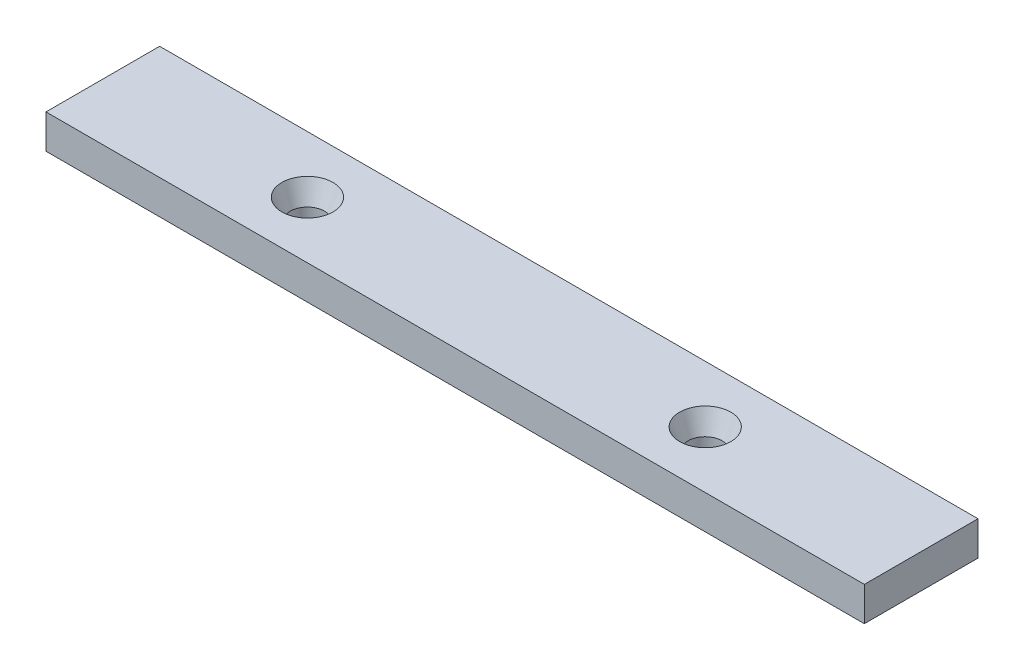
ISO-10303-21;
HEADER;
FILE_DESCRIPTION(('STEP AP214'),'2;1');
FILE_NAME('part.step','',(''),(''),'','','');
FILE_SCHEMA(('AUTOMOTIVE_DESIGN { 1 0 10303 214 1 1 1 1 }'));
ENDSEC;
DATA;
#1=APPLICATION_CONTEXT('core data for automotive mechanical design processes');
#2=APPLICATION_PROTOCOL_DEFINITION('international standard','automotive_design',2000,#1);
#3=PRODUCT_CONTEXT('',#1,'mechanical');
#4=PRODUCT('Part','Part','',(#3));
#5=PRODUCT_RELATED_PRODUCT_CATEGORY('part','',(#4));
#6=PRODUCT_DEFINITION_FORMATION('','',#4);
#7=PRODUCT_DEFINITION_CONTEXT('part definition',#1,'design');
#8=PRODUCT_DEFINITION('design','',#6,#7);
#9=PRODUCT_DEFINITION_SHAPE('','',#8);
#10=(LENGTH_UNIT() NAMED_UNIT(*) SI_UNIT(.MILLI.,.METRE.));
#11=(NAMED_UNIT(*) PLANE_ANGLE_UNIT() SI_UNIT($,.RADIAN.));
#12=(NAMED_UNIT(*) SI_UNIT($,.STERADIAN.) SOLID_ANGLE_UNIT());
#13=UNCERTAINTY_MEASURE_WITH_UNIT(LENGTH_MEASURE(1.E-05),#10,'distance_accuracy_value','');
#14=(GEOMETRIC_REPRESENTATION_CONTEXT(3) GLOBAL_UNCERTAINTY_ASSIGNED_CONTEXT((#13)) GLOBAL_UNIT_ASSIGNED_CONTEXT((#10,
#11,#12)) REPRESENTATION_CONTEXT('',''));
#15=CARTESIAN_POINT('',(0.,0.,0.));
#16=DIRECTION('',(0.,0.,1.));
#17=DIRECTION('',(1.,0.,0.));
#18=AXIS2_PLACEMENT_3D('',#15,#16,#17);
#19=CARTESIAN_POINT('',(72.0000000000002,6.,10.));
#20=DIRECTION('',(-1.,0.,0.));
#21=DIRECTION('',(0.,0.,1.));
#22=AXIS2_PLACEMENT_3D('',#19,#20,#21);
#23=PLANE('',#22);
#24=DIRECTION('',(0.,0.,-1.));
#25=VECTOR('',#24,1.);
#26=CARTESIAN_POINT('',(72.0000000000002,0.,10.));
#27=LINE('',#26,#25);
#28=CARTESIAN_POINT('',(72.0000000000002,0.,10.));
#29=VERTEX_POINT('',#28);
#30=CARTESIAN_POINT('',(72.0000000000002,0.,-10.0000000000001));
#31=VERTEX_POINT('',#30);
#32=EDGE_CURVE('E97',#29,#31,#27,.T.);
#33=ORIENTED_EDGE('',*,*,#32,.T.);
#34=DIRECTION('',(0.,-1.,0.));
#35=VECTOR('',#34,1.);
#36=CARTESIAN_POINT('',(72.0000000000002,6.,-10.0000000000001));
#37=LINE('',#36,#35);
#38=CARTESIAN_POINT('',(72.0000000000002,6.,-10.0000000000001));
#39=VERTEX_POINT('',#38);
#40=EDGE_CURVE('E11',#39,#31,#37,.T.);
#41=ORIENTED_EDGE('',*,*,#40,.F.);
#42=DIRECTION('',(0.,0.,-1.));
#43=VECTOR('',#42,1.);
#44=CARTESIAN_POINT('',(72.0000000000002,6.,10.));
#45=LINE('',#44,#43);
#46=CARTESIAN_POINT('',(72.0000000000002,6.,10.));
#47=VERTEX_POINT('',#46);
#48=EDGE_CURVE('E85',#47,#39,#45,.T.);
#49=ORIENTED_EDGE('',*,*,#48,.F.);
#50=DIRECTION('',(0.,-1.,0.));
#51=VECTOR('',#50,1.);
#52=CARTESIAN_POINT('',(72.0000000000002,6.,10.));
#53=LINE('',#52,#51);
#54=EDGE_CURVE('E93',#47,#29,#53,.T.);
#55=ORIENTED_EDGE('',*,*,#54,.T.);
#56=EDGE_LOOP('',(#33,#41,#49,#55));
#57=FACE_BOUND('',#56,.T.);
#58=ADVANCED_FACE('F34',(#57),#23,.F.);
#59=CARTESIAN_POINT('',(-72.0000000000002,6.,-10.0000000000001));
#60=DIRECTION('',(0.,0.,1.));
#61=DIRECTION('',(1.,0.,0.));
#62=AXIS2_PLACEMENT_3D('',#59,#60,#61);
#63=PLANE('',#62);
#64=DIRECTION('',(-1.,0.,0.));
#65=VECTOR('',#64,1.);
#66=CARTESIAN_POINT('',(-72.0000000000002,0.,-10.0000000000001));
#67=LINE('',#66,#65);
#68=CARTESIAN_POINT('',(-72.0000000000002,0.,-10.0000000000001));
#69=VERTEX_POINT('',#68);
#70=EDGE_CURVE('E89',#31,#69,#67,.T.);
#71=ORIENTED_EDGE('',*,*,#70,.T.);
#72=DIRECTION('',(0.,-1.,0.));
#73=VECTOR('',#72,1.);
#74=CARTESIAN_POINT('',(-72.0000000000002,6.,-10.0000000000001));
#75=LINE('',#74,#73);
#76=CARTESIAN_POINT('',(-72.0000000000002,6.,-10.0000000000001));
#77=VERTEX_POINT('',#76);
#78=EDGE_CURVE('E42',#77,#69,#75,.T.);
#79=ORIENTED_EDGE('',*,*,#78,.F.);
#80=DIRECTION('',(-1.,0.,0.));
#81=VECTOR('',#80,1.);
#82=CARTESIAN_POINT('',(-72.0000000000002,6.,-10.0000000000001));
#83=LINE('',#82,#81);
#84=EDGE_CURVE('E80',#39,#77,#83,.T.);
#85=ORIENTED_EDGE('',*,*,#84,.F.);
#86=ORIENTED_EDGE('',*,*,#40,.T.);
#87=EDGE_LOOP('',(#71,#79,#85,#86));
#88=FACE_BOUND('',#87,.T.);
#89=ADVANCED_FACE('F88',(#88),#63,.F.);
#90=CARTESIAN_POINT('',(-72.0000000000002,6.,10.));
#91=DIRECTION('',(1.,0.,0.));
#92=DIRECTION('',(0.,0.,-1.));
#93=AXIS2_PLACEMENT_3D('',#90,#91,#92);
#94=PLANE('',#93);
#95=DIRECTION('',(0.,0.,1.));
#96=VECTOR('',#95,1.);
#97=CARTESIAN_POINT('',(-72.0000000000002,0.,10.));
#98=LINE('',#97,#96);
#99=CARTESIAN_POINT('',(-72.0000000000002,0.,10.));
#100=VERTEX_POINT('',#99);
#101=EDGE_CURVE('E67',#69,#100,#98,.T.);
#102=ORIENTED_EDGE('',*,*,#101,.T.);
#103=DIRECTION('',(0.,-1.,0.));
#104=VECTOR('',#103,1.);
#105=CARTESIAN_POINT('',(-72.0000000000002,6.,10.));
#106=LINE('',#105,#104);
#107=CARTESIAN_POINT('',(-72.0000000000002,6.,10.));
#108=VERTEX_POINT('',#107);
#109=EDGE_CURVE('E90',#108,#100,#106,.T.);
#110=ORIENTED_EDGE('',*,*,#109,.F.);
#111=DIRECTION('',(0.,0.,1.));
#112=VECTOR('',#111,1.);
#113=CARTESIAN_POINT('',(-72.0000000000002,6.,10.));
#114=LINE('',#113,#112);
#115=EDGE_CURVE('E83',#77,#108,#114,.T.);
#116=ORIENTED_EDGE('',*,*,#115,.F.);
#117=ORIENTED_EDGE('',*,*,#78,.T.);
#118=EDGE_LOOP('',(#102,#110,#116,#117));
#119=FACE_BOUND('',#118,.T.);
#120=ADVANCED_FACE('F91',(#119),#94,.F.);
#121=CARTESIAN_POINT('',(-72.0000000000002,6.,10.));
#122=DIRECTION('',(0.,0.,-1.));
#123=DIRECTION('',(-1.,0.,0.));
#124=AXIS2_PLACEMENT_3D('',#121,#122,#123);
#125=PLANE('',#124);
#126=DIRECTION('',(1.,0.,0.));
#127=VECTOR('',#126,1.);
#128=CARTESIAN_POINT('',(-72.0000000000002,0.,10.));
#129=LINE('',#128,#127);
#130=EDGE_CURVE('E73',#100,#29,#129,.T.);
#131=ORIENTED_EDGE('',*,*,#130,.T.);
#132=ORIENTED_EDGE('',*,*,#54,.F.);
#133=DIRECTION('',(1.,0.,0.));
#134=VECTOR('',#133,1.);
#135=CARTESIAN_POINT('',(-72.0000000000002,6.,10.));
#136=LINE('',#135,#134);
#137=EDGE_CURVE('E50',#108,#47,#136,.T.);
#138=ORIENTED_EDGE('',*,*,#137,.F.);
#139=ORIENTED_EDGE('',*,*,#109,.T.);
#140=EDGE_LOOP('',(#131,#132,#138,#139));
#141=FACE_BOUND('',#140,.T.);
#142=ADVANCED_FACE('F105',(#141),#125,.F.);
#143=CARTESIAN_POINT('',(72.0000000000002,6.,-10.0000000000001));
#144=DIRECTION('',(0.,-1.,0.));
#145=DIRECTION('',(0.,0.,-1.));
#146=AXIS2_PLACEMENT_3D('',#143,#144,#145);
#147=PLANE('',#146);
#148=CARTESIAN_POINT('',(-36.0000000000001,6.,0.));
#149=DIRECTION('',(0.,1.,0.));
#150=DIRECTION('',(0.,0.,1.));
#151=AXIS2_PLACEMENT_3D('',#148,#149,#150);
#152=CIRCLE('',#151,4.5);
#153=CARTESIAN_POINT('',(-36.0000000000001,6.,4.50000000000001));
#154=VERTEX_POINT('',#153);
#155=EDGE_CURVE('E125',#154,#154,#152,.T.);
#156=ORIENTED_EDGE('',*,*,#155,.F.);
#157=EDGE_LOOP('',(#156));
#158=FACE_BOUND('',#157,.T.);
#159=CARTESIAN_POINT('',(34.0000000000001,6.,0.));
#160=DIRECTION('',(0.,1.,0.));
#161=DIRECTION('',(0.,0.,1.));
#162=AXIS2_PLACEMENT_3D('',#159,#160,#161);
#163=CIRCLE('',#162,4.5);
#164=CARTESIAN_POINT('',(34.0000000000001,6.,4.50000000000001));
#165=VERTEX_POINT('',#164);
#166=EDGE_CURVE('E116',#165,#165,#163,.T.);
#167=ORIENTED_EDGE('',*,*,#166,.F.);
#168=EDGE_LOOP('',(#167));
#169=FACE_BOUND('',#168,.T.);
#170=ORIENTED_EDGE('',*,*,#48,.T.);
#171=ORIENTED_EDGE('',*,*,#84,.T.);
#172=ORIENTED_EDGE('',*,*,#115,.T.);
#173=ORIENTED_EDGE('',*,*,#137,.T.);
#174=EDGE_LOOP('',(#170,#171,#172,#173));
#175=FACE_BOUND('',#174,.T.);
#176=ADVANCED_FACE('F81',(#158,#169,#175),#147,.F.);
#177=CARTESIAN_POINT('',(72.0000000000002,0.,-10.0000000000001));
#178=DIRECTION('',(0.,-1.,0.));
#179=DIRECTION('',(0.,0.,-1.));
#180=AXIS2_PLACEMENT_3D('',#177,#178,#179);
#181=PLANE('',#180);
#182=CARTESIAN_POINT('',(-36.0000000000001,0.,0.));
#183=DIRECTION('',(0.,1.,0.));
#184=DIRECTION('',(0.,0.,1.));
#185=AXIS2_PLACEMENT_3D('',#182,#183,#184);
#186=CIRCLE('',#185,3.);
#187=CARTESIAN_POINT('',(-36.0000000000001,0.,3.00000000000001));
#188=VERTEX_POINT('',#187);
#189=EDGE_CURVE('E119',#188,#188,#186,.T.);
#190=ORIENTED_EDGE('',*,*,#189,.T.);
#191=EDGE_LOOP('',(#190));
#192=FACE_BOUND('',#191,.T.);
#193=CARTESIAN_POINT('',(34.0000000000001,0.,0.));
#194=DIRECTION('',(0.,1.,0.));
#195=DIRECTION('',(0.,0.,1.));
#196=AXIS2_PLACEMENT_3D('',#193,#194,#195);
#197=CIRCLE('',#196,3.);
#198=CARTESIAN_POINT('',(34.0000000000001,0.,3.00000000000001));
#199=VERTEX_POINT('',#198);
#200=EDGE_CURVE('E100',#199,#199,#197,.T.);
#201=ORIENTED_EDGE('',*,*,#200,.T.);
#202=EDGE_LOOP('',(#201));
#203=FACE_BOUND('',#202,.T.);
#204=ORIENTED_EDGE('',*,*,#32,.F.);
#205=ORIENTED_EDGE('',*,*,#130,.F.);
#206=ORIENTED_EDGE('',*,*,#101,.F.);
#207=ORIENTED_EDGE('',*,*,#70,.F.);
#208=EDGE_LOOP('',(#204,#205,#206,#207));
#209=FACE_BOUND('',#208,.T.);
#210=ADVANCED_FACE('F108',(#192,#203,#209),#181,.T.);
#211=CARTESIAN_POINT('',(34.0000000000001,6.,0.));
#212=DIRECTION('',(0.,1.,0.));
#213=DIRECTION('',(0.,0.,1.));
#214=AXIS2_PLACEMENT_3D('',#211,#212,#213);
#215=CYLINDRICAL_SURFACE('',#214,3.);
#216=ORIENTED_EDGE('',*,*,#200,.F.);
#217=EDGE_LOOP('',(#216));
#218=FACE_BOUND('',#217,.T.);
#219=CARTESIAN_POINT('',(34.0000000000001,2.37867965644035,0.));
#220=DIRECTION('',(0.,1.,0.));
#221=DIRECTION('',(0.,0.,1.));
#222=AXIS2_PLACEMENT_3D('',#219,#220,#221);
#223=CIRCLE('',#222,3.);
#224=CARTESIAN_POINT('',(34.0000000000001,2.37867965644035,3.00000000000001));
#225=VERTEX_POINT('',#224);
#226=EDGE_CURVE('E113',#225,#225,#223,.T.);
#227=ORIENTED_EDGE('',*,*,#226,.T.);
#228=EDGE_LOOP('',(#227));
#229=FACE_BOUND('',#228,.T.);
#230=ADVANCED_FACE('F139',(#218,#229),#215,.F.);
#231=CARTESIAN_POINT('',(34.0000000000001,6.,0.));
#232=DIRECTION('',(0.,1.,0.));
#233=DIRECTION('',(0.,0.,1.));
#234=AXIS2_PLACEMENT_3D('',#231,#232,#233);
#235=CONICAL_SURFACE('',#234,4.5,0.392699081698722);
#236=ORIENTED_EDGE('',*,*,#226,.F.);
#237=EDGE_LOOP('',(#236));
#238=FACE_BOUND('',#237,.T.);
#239=ORIENTED_EDGE('',*,*,#166,.T.);
#240=EDGE_LOOP('',(#239));
#241=FACE_BOUND('',#240,.T.);
#242=ADVANCED_FACE('F136',(#238,#241),#235,.F.);
#243=CARTESIAN_POINT('',(-36.0000000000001,6.,0.));
#244=DIRECTION('',(0.,1.,0.));
#245=DIRECTION('',(0.,0.,1.));
#246=AXIS2_PLACEMENT_3D('',#243,#244,#245);
#247=CYLINDRICAL_SURFACE('',#246,3.);
#248=ORIENTED_EDGE('',*,*,#189,.F.);
#249=EDGE_LOOP('',(#248));
#250=FACE_BOUND('',#249,.T.);
#251=CARTESIAN_POINT('',(-36.0000000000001,2.37867965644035,0.));
#252=DIRECTION('',(0.,1.,0.));
#253=DIRECTION('',(0.,0.,1.));
#254=AXIS2_PLACEMENT_3D('',#251,#252,#253);
#255=CIRCLE('',#254,3.);
#256=CARTESIAN_POINT('',(-36.0000000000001,2.37867965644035,3.00000000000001));
#257=VERTEX_POINT('',#256);
#258=EDGE_CURVE('E122',#257,#257,#255,.T.);
#259=ORIENTED_EDGE('',*,*,#258,.T.);
#260=EDGE_LOOP('',(#259));
#261=FACE_BOUND('',#260,.T.);
#262=ADVANCED_FACE('F138',(#250,#261),#247,.F.);
#263=CARTESIAN_POINT('',(-36.0000000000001,6.,0.));
#264=DIRECTION('',(0.,1.,0.));
#265=DIRECTION('',(0.,0.,1.));
#266=AXIS2_PLACEMENT_3D('',#263,#264,#265);
#267=CONICAL_SURFACE('',#266,4.5,0.392699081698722);
#268=ORIENTED_EDGE('',*,*,#258,.F.);
#269=EDGE_LOOP('',(#268));
#270=FACE_BOUND('',#269,.T.);
#271=ORIENTED_EDGE('',*,*,#155,.T.);
#272=EDGE_LOOP('',(#271));
#273=FACE_BOUND('',#272,.T.);
#274=ADVANCED_FACE('F129',(#270,#273),#267,.F.);
#275=CLOSED_SHELL('',(#58,#89,#120,#142,#176,#210,#230,#242,#262,#274));
#276=MANIFOLD_SOLID_BREP('B2',#275);
#277=ADVANCED_BREP_SHAPE_REPRESENTATION('',(#18,#276),#14);
#278=SHAPE_DEFINITION_REPRESENTATION(#9,#277);
ENDSEC;
END-ISO-10303-21;
